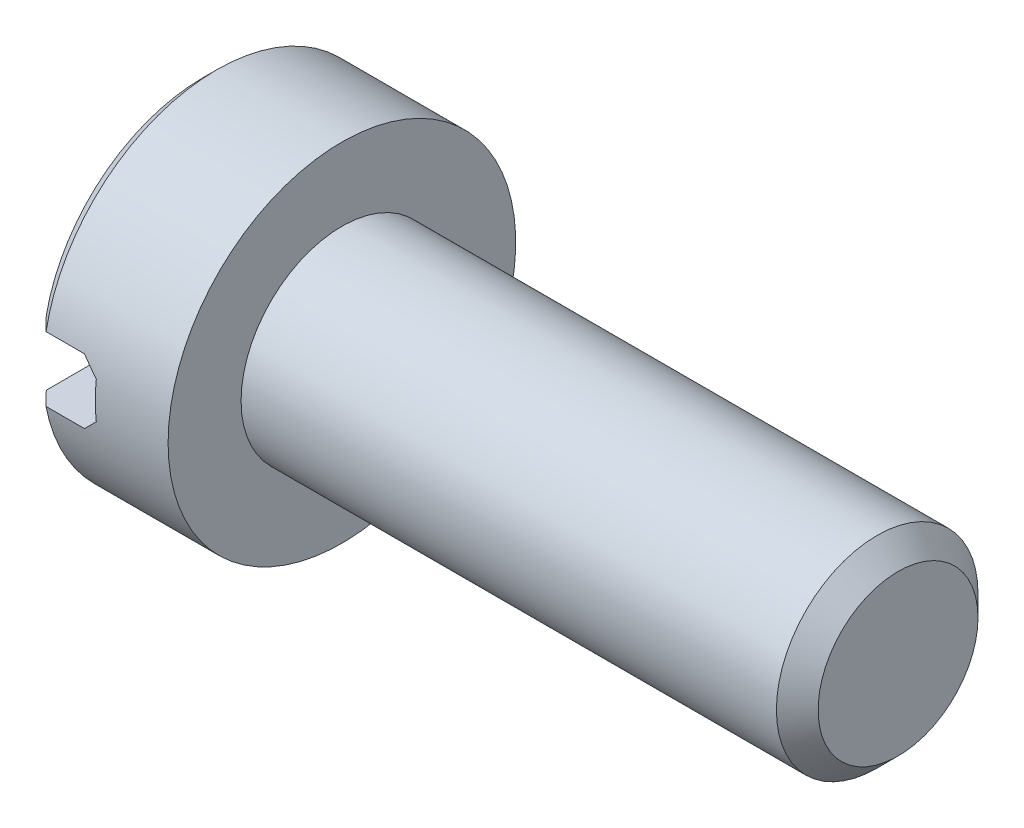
from build123d import *

# Parameters (mm, degrees)
ENL_V_MAT_EXTRU_1_DEPTH = 5
ESQUISSE3_R             = 1.45
EXTRUSION1_DEPTH        = 8
CHANFREIN1_SIZE         = 0.3


with BuildPart() as part:
    # Esquisse1 → R_volution1 (revolve)
    with BuildSketch(Plane.XY, mode=Mode.PRIVATE) as r_volution1_sk:
        Polygon((0, 0), (0, 2.3), (0.2, 2.5), (2, 2.5), (2, 0), align=None)
    revolve(r_volution1_sk.sketch.rotate(Axis((0, 0, 0), (1, 0, 0)), 90), axis=Axis((0, 0, 0), (1, 0, 0)))

    # Esquisse2 → Enl_v. mat.-Extru.1 (cut, symmetric)
    with BuildSketch(Plane.XY):
        Polygon((0, 0.465549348), (0.753445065, 0.465549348), (0.953445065, 0.265549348), (0.953445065, -0.265549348), (0.753445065, -0.465549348), (0, -0.465549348), align=None)
    extrude(amount=ENL_V_MAT_EXTRU_1_DEPTH, both=True, mode=Mode.SUBTRACT)

    # Esquisse3 → Extrusion1 (add)
    with BuildSketch(Plane(origin=(2, 0, 0), x_dir=(0, 0, -1), z_dir=(1, 0, 0))):
        with Locations(Location((0, 0, 0), (0, 0, 180))):
            Circle(ESQUISSE3_R)
    extrude(amount=EXTRUSION1_DEPTH)

    # Chanfrein1
    chanfrein1_edges = [part.edges().sort_by_distance(p)[0] for p in [
        (10, 0, -1.45),
    ]]
    chamfer(chanfrein1_edges, length=CHANFREIN1_SIZE)


solid = part.part
